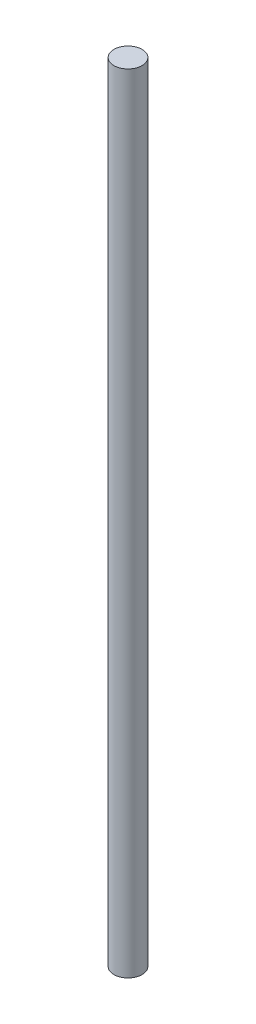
from build123d import *

# Parameters (mm, degrees)
SKETCH1_R           = 6.35
BOSS_EXTRUDE1_DEPTH = 355.6


with BuildPart() as part:
    # Sketch1 → Boss-Extrude1 (new body)
    with BuildSketch(Plane(origin=(0, 0, 0), x_dir=(1, 0, 0), z_dir=(0, 1, 0))):
        with Locations(Location((0, 0, 0), (0, 0, 270))):
            Circle(SKETCH1_R)
    extrude(amount=BOSS_EXTRUDE1_DEPTH)


solid = part.part
